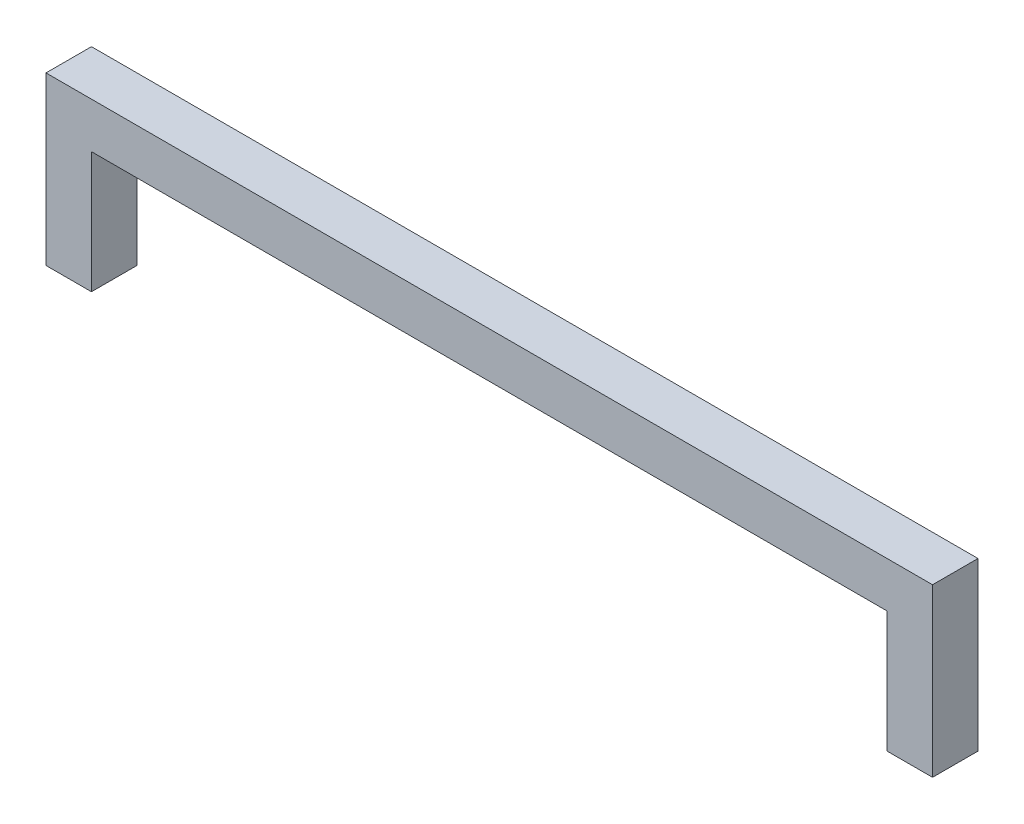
from build123d import *

# Parameters (mm, degrees)
SCHIZZO2_W   = 40
SCHIZZO2_H   = 40
SCHIZZO2_W_2 = 38
SCHIZZO2_H_2 = 38


with BuildPart() as part:
    # Sweep-Sottile1: sweep along a path in Schizzo1
    with BuildLine(Plane.XY) as sweep_sottile1_path:
        Line((0, 0), (0, 106.77))
        Line((0, 106.77), (700, 106.77))
        Line((700, 106.77), (700, 0))
    # Schizzo2 → Sweep-Sottile1 (sweep)
    with BuildSketch(Plane(origin=(0, 0, 0), x_dir=(1, 0, 0), z_dir=(0, 1, 0))):
        with Locations((-20, -20)):
            Rectangle(SCHIZZO2_W, SCHIZZO2_H)
        with Locations((-20, -20)):
            Rectangle(SCHIZZO2_W_2, SCHIZZO2_H_2, mode=Mode.SUBTRACT)
    sweep(path=sweep_sottile1_path.line, transition=Transition.RIGHT)


solid = part.part
